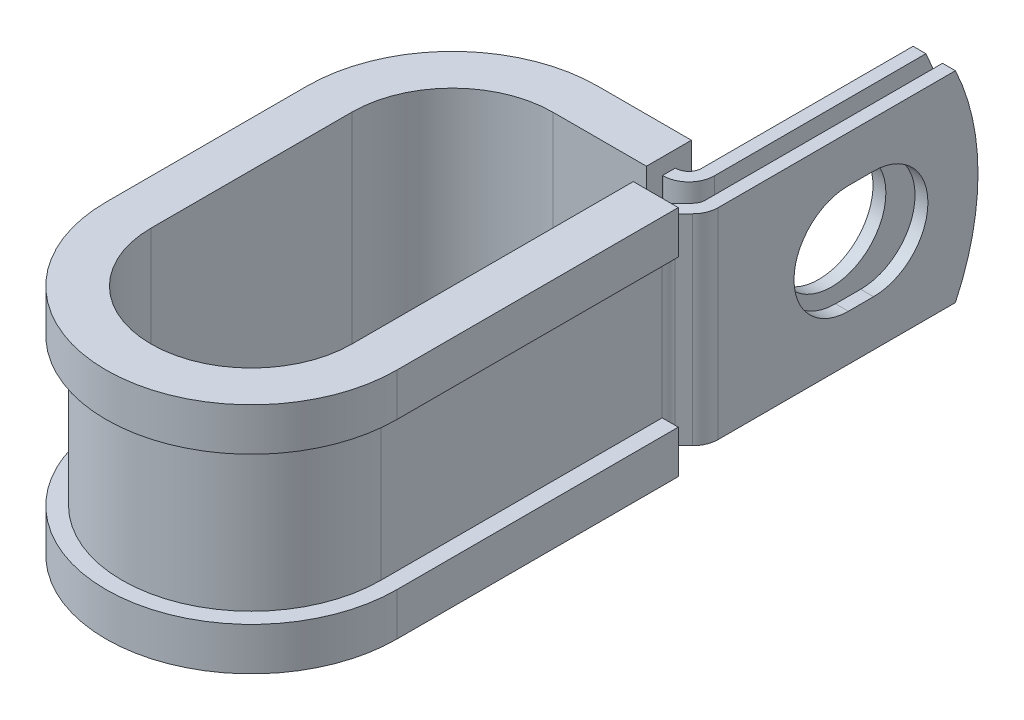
from build123d import *

# Parameters (mm, degrees)
EXTRUDE_THIN1_DEPTH = 9.525
SKETCH2_R           = 5.1562
CUT_EXTRUDE1_DEPTH  = 1.2192
CUT_EXTRUDE2_DEPTH  = 1.2192
CUT_EXTRUDE3_DEPTH  = 44.208494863


with BuildPart() as part:
    # Sketch1 → Extrude-Thin1 (new, symmetric)
    with BuildSketch(Plane(origin=(0, 0, 0), x_dir=(1, 0, 0), z_dir=(0, 1, 0))):
        with BuildLine():
            Line((12.9464698, 35.687), (12.9464698, 11.049))
            ThreePointArc((12.9464698, 11.049), (12.853663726, 10.582432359), (12.589374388, 10.186895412))
            Line((12.589374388, 10.186895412), (11.763190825, 9.360711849))
            ThreePointArc((11.763190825, 9.360711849), (11.234612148, 8.569637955), (11.049, 7.636502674))
            Line((11.049, 7.636502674), (11.049, 0))
            Line((11.049, 0), (11.049, -19.05))
            ThreePointArc((11.049, -19.05), (0, -30.099), (-11.049, -19.05))
            Line((-11.049, -19.05), (-11.049, 0))
            ThreePointArc((-11.049, 0), (-7.812822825, 7.812822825), (0, 11.049))
            Line((0, 11.049), (8.9332698, 11.049))
            ThreePointArc((8.9332698, 11.049), (10.657478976, 11.763190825), (11.3716698, 13.4874))
            Line((11.3716698, 13.4874), (11.3716698, 35.687))
            Line((11.3716698, 35.687), (10.1524698, 35.687))
            Line((10.1524698, 35.687), (10.1524698, 13.4874))
            ThreePointArc((10.1524698, 13.4874), (9.795374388, 12.625295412), (8.9332698, 12.2682))
            Line((8.9332698, 12.2682), (0, 12.2682))
            ThreePointArc((0, 12.2682), (-8.674927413, 8.674927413), (-12.2682, 0))
            Line((-12.2682, 0), (-12.2682, -19.05))
            ThreePointArc((-12.2682, -19.05), (0, -31.3182), (12.2682, -19.05))
            Line((12.2682, -19.05), (12.2682, 0))
            Line((12.2682, 0), (12.2682, 7.636502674))
            ThreePointArc((12.2682, 7.636502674), (12.361006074, 8.103070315), (12.625295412, 8.498607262))
            Line((12.625295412, 8.498607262), (13.451478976, 9.324790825))
            ThreePointArc((13.451478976, 9.324790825), (13.980057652, 10.115864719), (14.1656698, 11.049))
            Line((14.1656698, 11.049), (14.1656698, 35.687))
            Line((14.1656698, 35.687), (12.9464698, 35.687))
        make_face()
    extrude(amount=EXTRUDE_THIN1_DEPTH, both=True)

    # Sketch2 → Cut-Extrude1 (cut)
    with BuildSketch(Plane.ZY.offset(-10.1524698)):
        with Locations((-24.5872, 0)):
            Circle(SKETCH2_R)
    extrude(amount=-CUT_EXTRUDE1_DEPTH, mode=Mode.SUBTRACT)

    # Sketch3 → Cut-Extrude2 (cut)
    with BuildSketch(Plane(origin=(14.1656698, 0, 0), x_dir=(0, 0, -1), z_dir=(1, 0, 0))):
        with BuildLine():
            Line((23.3934, 5.1562), (25.781, 5.1562))
            ThreePointArc((25.781, 5.1562), (30.9372, 0), (25.781, -5.1562))
            Line((25.781, -5.1562), (23.3934, -5.1562))
            ThreePointArc((23.3934, -5.1562), (18.2372, 0), (23.3934, 5.1562))
        make_face()
    extrude(amount=-CUT_EXTRUDE2_DEPTH, mode=Mode.SUBTRACT)

    # Sketch4 → Cut-Extrude3 (cut, through all)
    with BuildSketch(Plane.ZY.offset(-10.1524698)):
        with BuildLine():
            Line((-33.542463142, 9.525), (-35.687, 9.525))
            Line((-35.687, 9.525), (-35.687, 0))
            ThreePointArc((-35.687, 0), (-35.144238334, 4.881717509), (-33.542463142, 9.525))
        make_face()
        with BuildLine():
            ThreePointArc((-33.542463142, -9.525), (-35.144238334, -4.881717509), (-35.687, 0))
            Line((-35.687, 0), (-35.687, -9.525))
            Line((-35.687, -9.525), (-33.542463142, -9.525))
        make_face()
    extrude(amount=-CUT_EXTRUDE3_DEPTH, mode=Mode.SUBTRACT)

    # Sweep1: sweep along a path in Sketch6
    with BuildLine(Plane(origin=(0, 9.525, 0), x_dir=(1, 0, 0), z_dir=(0, 1, 0))) as sweep1_path:
        Line((9.525, 7.636502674), (9.525, 0))
        Line((9.525, 0), (9.525, -19.05))
        ThreePointArc((9.525, -19.05), (0, -28.575), (-9.525, -19.05))
        Line((-9.525, -19.05), (-9.525, 0))
        ThreePointArc((-9.525, 0), (-6.735192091, 6.735192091), (0, 9.525))
        Line((0, 9.525), (8.8824698, 9.525))
    # Sketch5 → Sweep1 (sweep)
    with BuildSketch(Plane(origin=(0, 0, -7.636502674), x_dir=(-1, 0, 0), z_dir=(0, 0, -1))):
        Polygon((-12.2682, 9.525), (-11.049, 9.525), (-11.049, -9.525), (-12.2682, -9.525), (-12.2682, -6.985), (-13.7922, -6.985), (-13.7922, -11.049), (-9.525, -11.049), (-9.525, 11.049), (-13.7922, 11.049), (-13.7922, 6.985), (-12.2682, 6.985), align=None)
    sweep(path=sweep1_path.line)


solid = part.part
